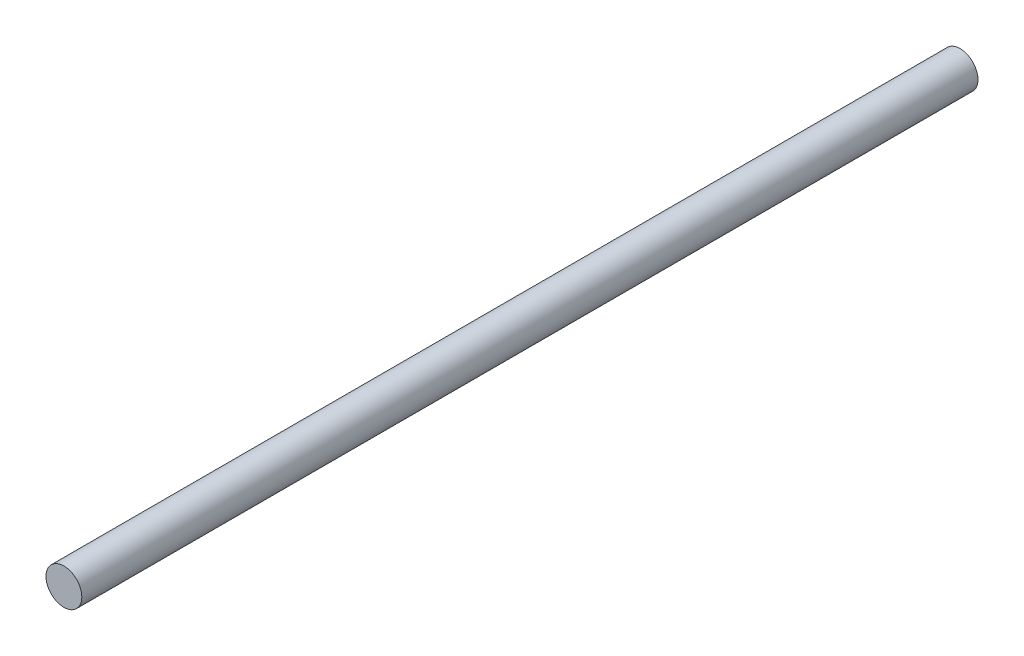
from build123d import *

# Parameters (mm, degrees)
SKETCH1_W = 0.635
SKETCH1_H = 31.75


with BuildPart() as part:
    # Sketch1 → Revolve1 (revolve)
    with BuildSketch(Plane(origin=(0, 0, 0), x_dir=(1, 0, 0), z_dir=(0, 1, 0)), mode=Mode.PRIVATE) as revolve1_sk:
        with Locations((-21.264382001, -26.929065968)):
            Rectangle(SKETCH1_W, SKETCH1_H)
    revolve(revolve1_sk.sketch.rotate(Axis((-20.946882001, 0, 42.804065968), (0, 0, -1)), 180), axis=Axis((-20.946882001, 0, 42.804065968), (0, 0, -1)))


solid = part.part
